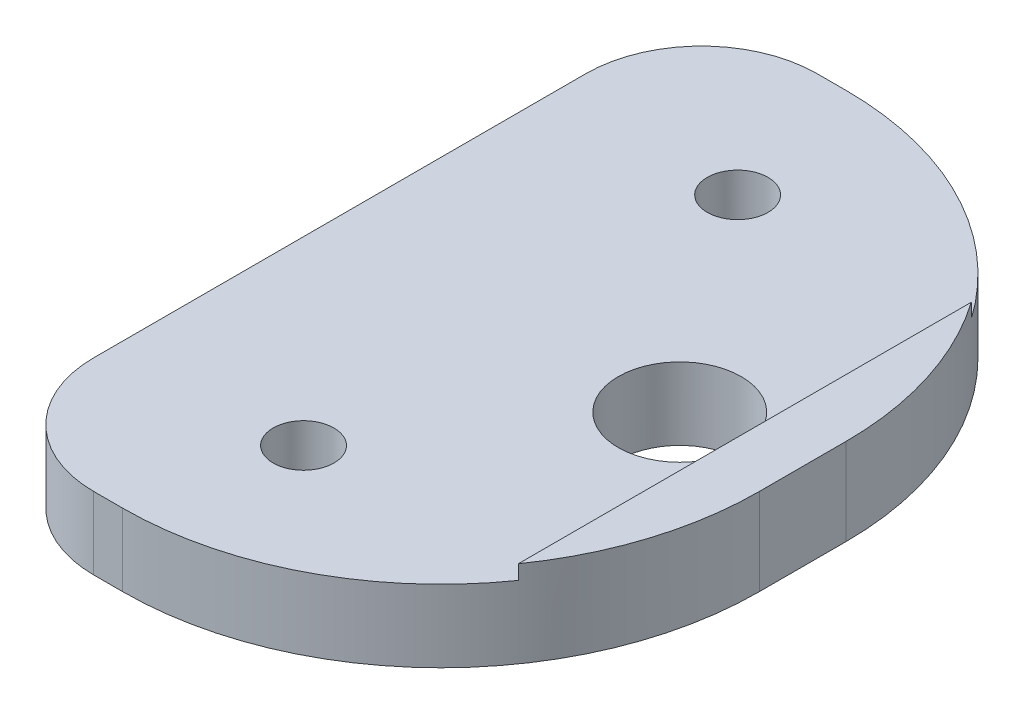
ISO-10303-21;
HEADER;
FILE_DESCRIPTION(('STEP AP214'),'2;1');
FILE_NAME('part.step','',(''),(''),'','','');
FILE_SCHEMA(('AUTOMOTIVE_DESIGN { 1 0 10303 214 1 1 1 1 }'));
ENDSEC;
DATA;
#1=APPLICATION_CONTEXT('core data for automotive mechanical design processes');
#2=APPLICATION_PROTOCOL_DEFINITION('international standard','automotive_design',2000,#1);
#3=PRODUCT_CONTEXT('',#1,'mechanical');
#4=PRODUCT('Part','Part','',(#3));
#5=PRODUCT_RELATED_PRODUCT_CATEGORY('part','',(#4));
#6=PRODUCT_DEFINITION_FORMATION('','',#4);
#7=PRODUCT_DEFINITION_CONTEXT('part definition',#1,'design');
#8=PRODUCT_DEFINITION('design','',#6,#7);
#9=PRODUCT_DEFINITION_SHAPE('','',#8);
#10=(LENGTH_UNIT() NAMED_UNIT(*) SI_UNIT(.MILLI.,.METRE.));
#11=(NAMED_UNIT(*) PLANE_ANGLE_UNIT() SI_UNIT($,.RADIAN.));
#12=(NAMED_UNIT(*) SI_UNIT($,.STERADIAN.) SOLID_ANGLE_UNIT());
#13=UNCERTAINTY_MEASURE_WITH_UNIT(LENGTH_MEASURE(1.E-05),#10,'distance_accuracy_value','');
#14=(GEOMETRIC_REPRESENTATION_CONTEXT(3) GLOBAL_UNCERTAINTY_ASSIGNED_CONTEXT((#13)) GLOBAL_UNIT_ASSIGNED_CONTEXT((#10,
#11,#12)) REPRESENTATION_CONTEXT('',''));
#15=CARTESIAN_POINT('',(0.,0.,0.));
#16=DIRECTION('',(0.,0.,1.));
#17=DIRECTION('',(1.,0.,0.));
#18=AXIS2_PLACEMENT_3D('',#15,#16,#17);
#19=CARTESIAN_POINT('',(16.,0.,-25.));
#20=DIRECTION('',(1.,0.,0.));
#21=DIRECTION('',(0.,0.,-1.));
#22=AXIS2_PLACEMENT_3D('',#19,#20,#21);
#23=PLANE('',#22);
#24=DIRECTION('',(0.,0.,1.));
#25=VECTOR('',#24,1.);
#26=CARTESIAN_POINT('',(16.,0.,-25.));
#27=LINE('',#26,#25);
#28=CARTESIAN_POINT('',(16.,0.,-3.));
#29=VERTEX_POINT('',#28);
#30=CARTESIAN_POINT('',(16.,0.,3.));
#31=VERTEX_POINT('',#30);
#32=EDGE_CURVE('E141',#29,#31,#27,.T.);
#33=ORIENTED_EDGE('',*,*,#32,.F.);
#34=DIRECTION('',(0.,1.,0.));
#35=VECTOR('',#34,1.);
#36=CARTESIAN_POINT('',(16.,6.,-3.));
#37=LINE('',#36,#35);
#38=CARTESIAN_POINT('',(16.,6.,-3.));
#39=VERTEX_POINT('',#38);
#40=EDGE_CURVE('E176',#29,#39,#37,.T.);
#41=ORIENTED_EDGE('',*,*,#40,.T.);
#42=DIRECTION('',(0.,0.,1.));
#43=VECTOR('',#42,1.);
#44=CARTESIAN_POINT('',(16.,6.,-25.));
#45=LINE('',#44,#43);
#46=CARTESIAN_POINT('',(16.,6.,3.));
#47=VERTEX_POINT('',#46);
#48=EDGE_CURVE('E165',#39,#47,#45,.T.);
#49=ORIENTED_EDGE('',*,*,#48,.T.);
#50=DIRECTION('',(0.,1.,0.));
#51=VECTOR('',#50,1.);
#52=CARTESIAN_POINT('',(16.,0.,3.));
#53=LINE('',#52,#51);
#54=EDGE_CURVE('E171',#47,#31,#53,.F.);
#55=ORIENTED_EDGE('',*,*,#54,.T.);
#56=EDGE_LOOP('',(#33,#41,#49,#55));
#57=FACE_BOUND('',#56,.T.);
#58=ADVANCED_FACE('F38',(#57),#23,.T.);
#59=CARTESIAN_POINT('',(-16.,0.,-25.));
#60=DIRECTION('',(0.,-1.,0.));
#61=DIRECTION('',(0.,0.,-1.));
#62=AXIS2_PLACEMENT_3D('',#59,#60,#61);
#63=PLANE('',#62);
#64=CARTESIAN_POINT('',(-3.5,0.,-15.));
#65=DIRECTION('',(0.,-1.,0.));
#66=DIRECTION('',(0.,0.,-1.));
#67=AXIS2_PLACEMENT_3D('',#64,#65,#66);
#68=CIRCLE('',#67,2.1);
#69=CARTESIAN_POINT('',(-3.5,0.,-17.1));
#70=VERTEX_POINT('',#69);
#71=EDGE_CURVE('E204',#70,#70,#68,.T.);
#72=ORIENTED_EDGE('',*,*,#71,.F.);
#73=EDGE_LOOP('',(#72));
#74=FACE_BOUND('',#73,.T.);
#75=CARTESIAN_POINT('',(-3.5,0.,15.));
#76=DIRECTION('',(0.,-1.,0.));
#77=DIRECTION('',(0.,0.,-1.));
#78=AXIS2_PLACEMENT_3D('',#75,#76,#77);
#79=CIRCLE('',#78,2.1);
#80=CARTESIAN_POINT('',(-3.5,0.,12.9));
#81=VERTEX_POINT('',#80);
#82=EDGE_CURVE('E209',#81,#81,#79,.T.);
#83=ORIENTED_EDGE('',*,*,#82,.F.);
#84=EDGE_LOOP('',(#83));
#85=FACE_BOUND('',#84,.T.);
#86=CARTESIAN_POINT('',(7.5,0.,0.));
#87=DIRECTION('',(0.,-1.,0.));
#88=DIRECTION('',(0.,0.,-1.));
#89=AXIS2_PLACEMENT_3D('',#86,#87,#88);
#90=CIRCLE('',#89,4.25);
#91=CARTESIAN_POINT('',(7.5,0.,-4.25));
#92=VERTEX_POINT('',#91);
#93=EDGE_CURVE('E150',#92,#92,#90,.T.);
#94=ORIENTED_EDGE('',*,*,#93,.F.);
#95=EDGE_LOOP('',(#94));
#96=FACE_BOUND('',#95,.T.);
#97=DIRECTION('',(1.,0.,0.));
#98=VECTOR('',#97,1.);
#99=CARTESIAN_POINT('',(-16.,0.,25.));
#100=LINE('',#99,#98);
#101=CARTESIAN_POINT('',(-8.,0.,25.));
#102=VERTEX_POINT('',#101);
#103=CARTESIAN_POINT('',(-6.,0.,25.));
#104=VERTEX_POINT('',#103);
#105=EDGE_CURVE('E139',#102,#104,#100,.T.);
#106=ORIENTED_EDGE('',*,*,#105,.F.);
#107=CARTESIAN_POINT('',(-8.,0.,17.));
#108=DIRECTION('',(0.,-1.,0.));
#109=DIRECTION('',(0.,0.,-1.));
#110=AXIS2_PLACEMENT_3D('',#107,#108,#109);
#111=CIRCLE('',#110,8.);
#112=CARTESIAN_POINT('',(-16.,0.,17.));
#113=VERTEX_POINT('',#112);
#114=EDGE_CURVE('E194',#102,#113,#111,.T.);
#115=ORIENTED_EDGE('',*,*,#114,.T.);
#116=DIRECTION('',(0.,0.,1.));
#117=VECTOR('',#116,1.);
#118=CARTESIAN_POINT('',(-16.,0.,-25.));
#119=LINE('',#118,#117);
#120=CARTESIAN_POINT('',(-16.,0.,-17.));
#121=VERTEX_POINT('',#120);
#122=EDGE_CURVE('E157',#121,#113,#119,.T.);
#123=ORIENTED_EDGE('',*,*,#122,.F.);
#124=CARTESIAN_POINT('',(-8.,0.,-17.));
#125=DIRECTION('',(0.,-1.,0.));
#126=DIRECTION('',(0.,0.,-1.));
#127=AXIS2_PLACEMENT_3D('',#124,#125,#126);
#128=CIRCLE('',#127,8.);
#129=CARTESIAN_POINT('',(-8.,0.,-25.));
#130=VERTEX_POINT('',#129);
#131=EDGE_CURVE('E192',#121,#130,#128,.T.);
#132=ORIENTED_EDGE('',*,*,#131,.T.);
#133=DIRECTION('',(1.,0.,0.));
#134=VECTOR('',#133,1.);
#135=CARTESIAN_POINT('',(-16.,0.,-25.));
#136=LINE('',#135,#134);
#137=CARTESIAN_POINT('',(-6.,0.,-25.));
#138=VERTEX_POINT('',#137);
#139=EDGE_CURVE('E153',#130,#138,#136,.T.);
#140=ORIENTED_EDGE('',*,*,#139,.T.);
#141=CARTESIAN_POINT('',(-6.,0.,-3.));
#142=DIRECTION('',(0.,-1.,0.));
#143=DIRECTION('',(0.,0.,-1.));
#144=AXIS2_PLACEMENT_3D('',#141,#142,#143);
#145=CIRCLE('',#144,22.);
#146=EDGE_CURVE('E188',#138,#29,#145,.T.);
#147=ORIENTED_EDGE('',*,*,#146,.T.);
#148=ORIENTED_EDGE('',*,*,#32,.T.);
#149=CARTESIAN_POINT('',(-6.,0.,3.));
#150=DIRECTION('',(0.,-1.,0.));
#151=DIRECTION('',(0.,0.,-1.));
#152=AXIS2_PLACEMENT_3D('',#149,#150,#151);
#153=CIRCLE('',#152,22.);
#154=EDGE_CURVE('E174',#31,#104,#153,.T.);
#155=ORIENTED_EDGE('',*,*,#154,.T.);
#156=EDGE_LOOP('',(#106,#115,#123,#132,#140,#147,#148,#155));
#157=FACE_BOUND('',#156,.T.);
#158=ADVANCED_FACE('F219',(#74,#85,#96,#157),#63,.T.);
#159=CARTESIAN_POINT('',(-16.,0.,-25.));
#160=DIRECTION('',(-1.,0.,0.));
#161=DIRECTION('',(0.,0.,1.));
#162=AXIS2_PLACEMENT_3D('',#159,#160,#161);
#163=PLANE('',#162);
#164=ORIENTED_EDGE('',*,*,#122,.T.);
#165=DIRECTION('',(0.,-1.,0.));
#166=VECTOR('',#165,1.);
#167=CARTESIAN_POINT('',(-16.,0.,17.));
#168=LINE('',#167,#166);
#169=CARTESIAN_POINT('',(-16.,5.,17.));
#170=VERTEX_POINT('',#169);
#171=EDGE_CURVE('E61',#113,#170,#168,.F.);
#172=ORIENTED_EDGE('',*,*,#171,.T.);
#173=DIRECTION('',(0.,0.,1.));
#174=VECTOR('',#173,1.);
#175=CARTESIAN_POINT('',(-16.,5.,-25.));
#176=LINE('',#175,#174);
#177=CARTESIAN_POINT('',(-16.,5.,-17.));
#178=VERTEX_POINT('',#177);
#179=EDGE_CURVE('E159',#178,#170,#176,.T.);
#180=ORIENTED_EDGE('',*,*,#179,.F.);
#181=DIRECTION('',(0.,-1.,0.));
#182=VECTOR('',#181,1.);
#183=CARTESIAN_POINT('',(-16.,0.,-17.));
#184=LINE('',#183,#182);
#185=EDGE_CURVE('E196',#178,#121,#184,.T.);
#186=ORIENTED_EDGE('',*,*,#185,.T.);
#187=EDGE_LOOP('',(#164,#172,#180,#186));
#188=FACE_BOUND('',#187,.T.);
#189=ADVANCED_FACE('F237',(#188),#163,.T.);
#190=CARTESIAN_POINT('',(12.,5.,-25.));
#191=DIRECTION('',(0.,1.,0.));
#192=DIRECTION('',(-1.,0.,0.));
#193=AXIS2_PLACEMENT_3D('',#190,#191,#192);
#194=PLANE('',#193);
#195=CARTESIAN_POINT('',(-3.5,5.,-15.));
#196=DIRECTION('',(0.,1.,0.));
#197=DIRECTION('',(-1.,0.,0.));
#198=AXIS2_PLACEMENT_3D('',#195,#196,#197);
#199=CIRCLE('',#198,2.1);
#200=CARTESIAN_POINT('',(-5.6,5.,-15.));
#201=VERTEX_POINT('',#200);
#202=EDGE_CURVE('E42',#201,#201,#199,.T.);
#203=ORIENTED_EDGE('',*,*,#202,.F.);
#204=EDGE_LOOP('',(#203));
#205=FACE_BOUND('',#204,.T.);
#206=CARTESIAN_POINT('',(-3.5,5.,15.));
#207=DIRECTION('',(0.,1.,0.));
#208=DIRECTION('',(-1.,0.,0.));
#209=AXIS2_PLACEMENT_3D('',#206,#207,#208);
#210=CIRCLE('',#209,2.1);
#211=CARTESIAN_POINT('',(-5.6,5.,15.));
#212=VERTEX_POINT('',#211);
#213=EDGE_CURVE('E202',#212,#212,#210,.T.);
#214=ORIENTED_EDGE('',*,*,#213,.F.);
#215=EDGE_LOOP('',(#214));
#216=FACE_BOUND('',#215,.T.);
#217=CARTESIAN_POINT('',(7.5,5.,0.));
#218=DIRECTION('',(0.,1.,0.));
#219=DIRECTION('',(-1.,0.,0.));
#220=AXIS2_PLACEMENT_3D('',#217,#218,#219);
#221=CIRCLE('',#220,4.25);
#222=CARTESIAN_POINT('',(3.25,5.,0.));
#223=VERTEX_POINT('',#222);
#224=EDGE_CURVE('E145',#223,#223,#221,.T.);
#225=ORIENTED_EDGE('',*,*,#224,.F.);
#226=EDGE_LOOP('',(#225));
#227=FACE_BOUND('',#226,.T.);
#228=ORIENTED_EDGE('',*,*,#179,.T.);
#229=CARTESIAN_POINT('',(-8.,5.,17.));
#230=DIRECTION('',(0.,1.,0.));
#231=DIRECTION('',(-1.,0.,0.));
#232=AXIS2_PLACEMENT_3D('',#229,#230,#231);
#233=CIRCLE('',#232,8.);
#234=CARTESIAN_POINT('',(-8.,5.,25.));
#235=VERTEX_POINT('',#234);
#236=EDGE_CURVE('E47',#170,#235,#233,.T.);
#237=ORIENTED_EDGE('',*,*,#236,.T.);
#238=DIRECTION('',(-1.,0.,0.));
#239=VECTOR('',#238,1.);
#240=CARTESIAN_POINT('',(12.,5.,25.));
#241=LINE('',#240,#239);
#242=CARTESIAN_POINT('',(-6.,5.,25.));
#243=VERTEX_POINT('',#242);
#244=EDGE_CURVE('E136',#243,#235,#241,.T.);
#245=ORIENTED_EDGE('',*,*,#244,.F.);
#246=CARTESIAN_POINT('',(-6.,5.,3.));
#247=DIRECTION('',(0.,1.,0.));
#248=DIRECTION('',(-1.,0.,0.));
#249=AXIS2_PLACEMENT_3D('',#246,#247,#248);
#250=CIRCLE('',#249,22.);
#251=CARTESIAN_POINT('',(12.,5.,15.6491106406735));
#252=VERTEX_POINT('',#251);
#253=EDGE_CURVE('E120',#243,#252,#250,.T.);
#254=ORIENTED_EDGE('',*,*,#253,.T.);
#255=DIRECTION('',(0.,0.,1.));
#256=VECTOR('',#255,1.);
#257=CARTESIAN_POINT('',(12.,5.,-25.));
#258=LINE('',#257,#256);
#259=CARTESIAN_POINT('',(12.,5.,-15.6491106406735));
#260=VERTEX_POINT('',#259);
#261=EDGE_CURVE('E161',#260,#252,#258,.T.);
#262=ORIENTED_EDGE('',*,*,#261,.F.);
#263=CARTESIAN_POINT('',(-6.,5.,-3.));
#264=DIRECTION('',(0.,1.,0.));
#265=DIRECTION('',(-1.,0.,0.));
#266=AXIS2_PLACEMENT_3D('',#263,#264,#265);
#267=CIRCLE('',#266,22.);
#268=CARTESIAN_POINT('',(-6.,5.,-25.));
#269=VERTEX_POINT('',#268);
#270=EDGE_CURVE('E183',#260,#269,#267,.T.);
#271=ORIENTED_EDGE('',*,*,#270,.T.);
#272=DIRECTION('',(-1.,0.,0.));
#273=VECTOR('',#272,1.);
#274=CARTESIAN_POINT('',(12.,5.,-25.));
#275=LINE('',#274,#273);
#276=CARTESIAN_POINT('',(-8.,5.,-25.));
#277=VERTEX_POINT('',#276);
#278=EDGE_CURVE('E147',#269,#277,#275,.T.);
#279=ORIENTED_EDGE('',*,*,#278,.T.);
#280=CARTESIAN_POINT('',(-8.,5.,-17.));
#281=DIRECTION('',(0.,1.,0.));
#282=DIRECTION('',(-1.,0.,0.));
#283=AXIS2_PLACEMENT_3D('',#280,#281,#282);
#284=CIRCLE('',#283,8.);
#285=EDGE_CURVE('E200',#277,#178,#284,.T.);
#286=ORIENTED_EDGE('',*,*,#285,.T.);
#287=EDGE_LOOP('',(#228,#237,#245,#254,#262,#271,#279,#286));
#288=FACE_BOUND('',#287,.T.);
#289=ADVANCED_FACE('F143',(#205,#216,#227,#288),#194,.T.);
#290=CARTESIAN_POINT('',(12.,6.,-25.));
#291=DIRECTION('',(-1.,0.,0.));
#292=DIRECTION('',(0.,0.,1.));
#293=AXIS2_PLACEMENT_3D('',#290,#291,#292);
#294=PLANE('',#293);
#295=DIRECTION('',(0.,0.,1.));
#296=VECTOR('',#295,1.);
#297=CARTESIAN_POINT('',(12.,6.,-25.));
#298=LINE('',#297,#296);
#299=CARTESIAN_POINT('',(12.,6.,-15.6491106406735));
#300=VERTEX_POINT('',#299);
#301=CARTESIAN_POINT('',(12.,6.,15.6491106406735));
#302=VERTEX_POINT('',#301);
#303=EDGE_CURVE('E163',#300,#302,#298,.T.);
#304=ORIENTED_EDGE('',*,*,#303,.F.);
#305=DIRECTION('',(0.,-1.,0.));
#306=VECTOR('',#305,1.);
#307=CARTESIAN_POINT('',(12.,6.,-15.6491106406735));
#308=LINE('',#307,#306);
#309=EDGE_CURVE('E181',#300,#260,#308,.T.);
#310=ORIENTED_EDGE('',*,*,#309,.T.);
#311=ORIENTED_EDGE('',*,*,#261,.T.);
#312=DIRECTION('',(0.,1.,0.));
#313=VECTOR('',#312,1.);
#314=CARTESIAN_POINT('',(12.,5.,15.6491106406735));
#315=LINE('',#314,#313);
#316=EDGE_CURVE('E127',#252,#302,#315,.T.);
#317=ORIENTED_EDGE('',*,*,#316,.T.);
#318=EDGE_LOOP('',(#304,#310,#311,#317));
#319=FACE_BOUND('',#318,.T.);
#320=ADVANCED_FACE('F272',(#319),#294,.T.);
#321=CARTESIAN_POINT('',(16.,6.,-25.));
#322=DIRECTION('',(0.,1.,0.));
#323=DIRECTION('',(0.,0.,1.));
#324=AXIS2_PLACEMENT_3D('',#321,#322,#323);
#325=PLANE('',#324);
#326=ORIENTED_EDGE('',*,*,#48,.F.);
#327=CARTESIAN_POINT('',(-6.,6.,-3.));
#328=DIRECTION('',(0.,1.,0.));
#329=DIRECTION('',(0.,0.,1.));
#330=AXIS2_PLACEMENT_3D('',#327,#328,#329);
#331=CIRCLE('',#330,22.);
#332=EDGE_CURVE('E179',#39,#300,#331,.T.);
#333=ORIENTED_EDGE('',*,*,#332,.T.);
#334=ORIENTED_EDGE('',*,*,#303,.T.);
#335=CARTESIAN_POINT('',(-6.,6.,3.));
#336=DIRECTION('',(0.,1.,0.));
#337=DIRECTION('',(0.,0.,1.));
#338=AXIS2_PLACEMENT_3D('',#335,#336,#337);
#339=CIRCLE('',#338,22.);
#340=EDGE_CURVE('E168',#302,#47,#339,.T.);
#341=ORIENTED_EDGE('',*,*,#340,.T.);
#342=EDGE_LOOP('',(#326,#333,#334,#341));
#343=FACE_BOUND('',#342,.T.);
#344=ADVANCED_FACE('F233',(#343),#325,.T.);
#345=CARTESIAN_POINT('',(16.,6.,-25.));
#346=DIRECTION('',(0.,0.,1.));
#347=DIRECTION('',(1.,0.,0.));
#348=AXIS2_PLACEMENT_3D('',#345,#346,#347);
#349=PLANE('',#348);
#350=ORIENTED_EDGE('',*,*,#139,.F.);
#351=DIRECTION('',(0.,-1.,0.));
#352=VECTOR('',#351,1.);
#353=CARTESIAN_POINT('',(-8.,5.,-25.));
#354=LINE('',#353,#352);
#355=EDGE_CURVE('E11',#130,#277,#354,.F.);
#356=ORIENTED_EDGE('',*,*,#355,.T.);
#357=ORIENTED_EDGE('',*,*,#278,.F.);
#358=DIRECTION('',(0.,1.,0.));
#359=VECTOR('',#358,1.);
#360=CARTESIAN_POINT('',(-6.,0.,-25.));
#361=LINE('',#360,#359);
#362=EDGE_CURVE('E185',#269,#138,#361,.F.);
#363=ORIENTED_EDGE('',*,*,#362,.T.);
#364=EDGE_LOOP('',(#350,#356,#357,#363));
#365=FACE_BOUND('',#364,.T.);
#366=ADVANCED_FACE('F224',(#365),#349,.F.);
#367=CARTESIAN_POINT('',(16.,6.,25.));
#368=DIRECTION('',(0.,0.,1.));
#369=DIRECTION('',(1.,0.,0.));
#370=AXIS2_PLACEMENT_3D('',#367,#368,#369);
#371=PLANE('',#370);
#372=ORIENTED_EDGE('',*,*,#244,.T.);
#373=DIRECTION('',(0.,-1.,0.));
#374=VECTOR('',#373,1.);
#375=CARTESIAN_POINT('',(-8.,6.,25.));
#376=LINE('',#375,#374);
#377=EDGE_CURVE('E190',#235,#102,#376,.T.);
#378=ORIENTED_EDGE('',*,*,#377,.T.);
#379=ORIENTED_EDGE('',*,*,#105,.T.);
#380=DIRECTION('',(0.,1.,0.));
#381=VECTOR('',#380,1.);
#382=CARTESIAN_POINT('',(-6.,6.,25.));
#383=LINE('',#382,#381);
#384=EDGE_CURVE('E124',#104,#243,#383,.T.);
#385=ORIENTED_EDGE('',*,*,#384,.T.);
#386=EDGE_LOOP('',(#372,#378,#379,#385));
#387=FACE_BOUND('',#386,.T.);
#388=ADVANCED_FACE('F134',(#387),#371,.T.);
#389=CARTESIAN_POINT('',(-6.,6.,3.));
#390=DIRECTION('',(0.,1.,0.));
#391=DIRECTION('',(0.,0.,1.));
#392=AXIS2_PLACEMENT_3D('',#389,#390,#391);
#393=CYLINDRICAL_SURFACE('',#392,22.);
#394=ORIENTED_EDGE('',*,*,#154,.F.);
#395=ORIENTED_EDGE('',*,*,#54,.F.);
#396=ORIENTED_EDGE('',*,*,#340,.F.);
#397=ORIENTED_EDGE('',*,*,#316,.F.);
#398=ORIENTED_EDGE('',*,*,#253,.F.);
#399=ORIENTED_EDGE('',*,*,#384,.F.);
#400=EDGE_LOOP('',(#394,#395,#396,#397,#398,#399));
#401=FACE_BOUND('',#400,.T.);
#402=ADVANCED_FACE('F123',(#401),#393,.T.);
#403=CARTESIAN_POINT('',(-6.,0.,-3.));
#404=DIRECTION('',(0.,-1.,0.));
#405=DIRECTION('',(0.,0.,-1.));
#406=AXIS2_PLACEMENT_3D('',#403,#404,#405);
#407=CYLINDRICAL_SURFACE('',#406,22.);
#408=ORIENTED_EDGE('',*,*,#146,.F.);
#409=ORIENTED_EDGE('',*,*,#362,.F.);
#410=ORIENTED_EDGE('',*,*,#270,.F.);
#411=ORIENTED_EDGE('',*,*,#309,.F.);
#412=ORIENTED_EDGE('',*,*,#332,.F.);
#413=ORIENTED_EDGE('',*,*,#40,.F.);
#414=EDGE_LOOP('',(#408,#409,#410,#411,#412,#413));
#415=FACE_BOUND('',#414,.T.);
#416=ADVANCED_FACE('F228',(#415),#407,.T.);
#417=CARTESIAN_POINT('',(-8.,6.,17.));
#418=DIRECTION('',(0.,-1.,0.));
#419=DIRECTION('',(0.,0.,-1.));
#420=AXIS2_PLACEMENT_3D('',#417,#418,#419);
#421=CYLINDRICAL_SURFACE('',#420,8.);
#422=ORIENTED_EDGE('',*,*,#236,.F.);
#423=ORIENTED_EDGE('',*,*,#171,.F.);
#424=ORIENTED_EDGE('',*,*,#114,.F.);
#425=ORIENTED_EDGE('',*,*,#377,.F.);
#426=EDGE_LOOP('',(#422,#423,#424,#425));
#427=FACE_BOUND('',#426,.T.);
#428=ADVANCED_FACE('F239',(#427),#421,.T.);
#429=CARTESIAN_POINT('',(-8.,0.,-17.));
#430=DIRECTION('',(0.,1.,0.));
#431=DIRECTION('',(0.,0.,1.));
#432=AXIS2_PLACEMENT_3D('',#429,#430,#431);
#433=CYLINDRICAL_SURFACE('',#432,8.);
#434=ORIENTED_EDGE('',*,*,#285,.F.);
#435=ORIENTED_EDGE('',*,*,#355,.F.);
#436=ORIENTED_EDGE('',*,*,#131,.F.);
#437=ORIENTED_EDGE('',*,*,#185,.F.);
#438=EDGE_LOOP('',(#434,#435,#436,#437));
#439=FACE_BOUND('',#438,.T.);
#440=ADVANCED_FACE('F40',(#439),#433,.T.);
#441=CARTESIAN_POINT('',(7.5,6.,0.));
#442=DIRECTION('',(0.,-1.,0.));
#443=DIRECTION('',(0.,0.,-1.));
#444=AXIS2_PLACEMENT_3D('',#441,#442,#443);
#445=CYLINDRICAL_SURFACE('',#444,4.25);
#446=ORIENTED_EDGE('',*,*,#224,.T.);
#447=EDGE_LOOP('',(#446));
#448=FACE_BOUND('',#447,.T.);
#449=ORIENTED_EDGE('',*,*,#93,.T.);
#450=EDGE_LOOP('',(#449));
#451=FACE_BOUND('',#450,.T.);
#452=ADVANCED_FACE('F245',(#448,#451),#445,.F.);
#453=CARTESIAN_POINT('',(-3.5,6.,15.));
#454=DIRECTION('',(0.,-1.,0.));
#455=DIRECTION('',(0.,0.,-1.));
#456=AXIS2_PLACEMENT_3D('',#453,#454,#455);
#457=CYLINDRICAL_SURFACE('',#456,2.1);
#458=ORIENTED_EDGE('',*,*,#213,.T.);
#459=EDGE_LOOP('',(#458));
#460=FACE_BOUND('',#459,.T.);
#461=ORIENTED_EDGE('',*,*,#82,.T.);
#462=EDGE_LOOP('',(#461));
#463=FACE_BOUND('',#462,.T.);
#464=ADVANCED_FACE('F328',(#460,#463),#457,.F.);
#465=CARTESIAN_POINT('',(-3.5,6.,-15.));
#466=DIRECTION('',(0.,-1.,0.));
#467=DIRECTION('',(0.,0.,-1.));
#468=AXIS2_PLACEMENT_3D('',#465,#466,#467);
#469=CYLINDRICAL_SURFACE('',#468,2.1);
#470=ORIENTED_EDGE('',*,*,#202,.T.);
#471=EDGE_LOOP('',(#470));
#472=FACE_BOUND('',#471,.T.);
#473=ORIENTED_EDGE('',*,*,#71,.T.);
#474=EDGE_LOOP('',(#473));
#475=FACE_BOUND('',#474,.T.);
#476=ADVANCED_FACE('F337',(#472,#475),#469,.F.);
#477=CLOSED_SHELL('',(#58,#158,#189,#289,#320,#344,#366,#388,#402,#416,#428,#440,#452,#464,#476));
#478=MANIFOLD_SOLID_BREP('B2',#477);
#479=ADVANCED_BREP_SHAPE_REPRESENTATION('',(#18,#478),#14);
#480=SHAPE_DEFINITION_REPRESENTATION(#9,#479);
ENDSEC;
END-ISO-10303-21;
